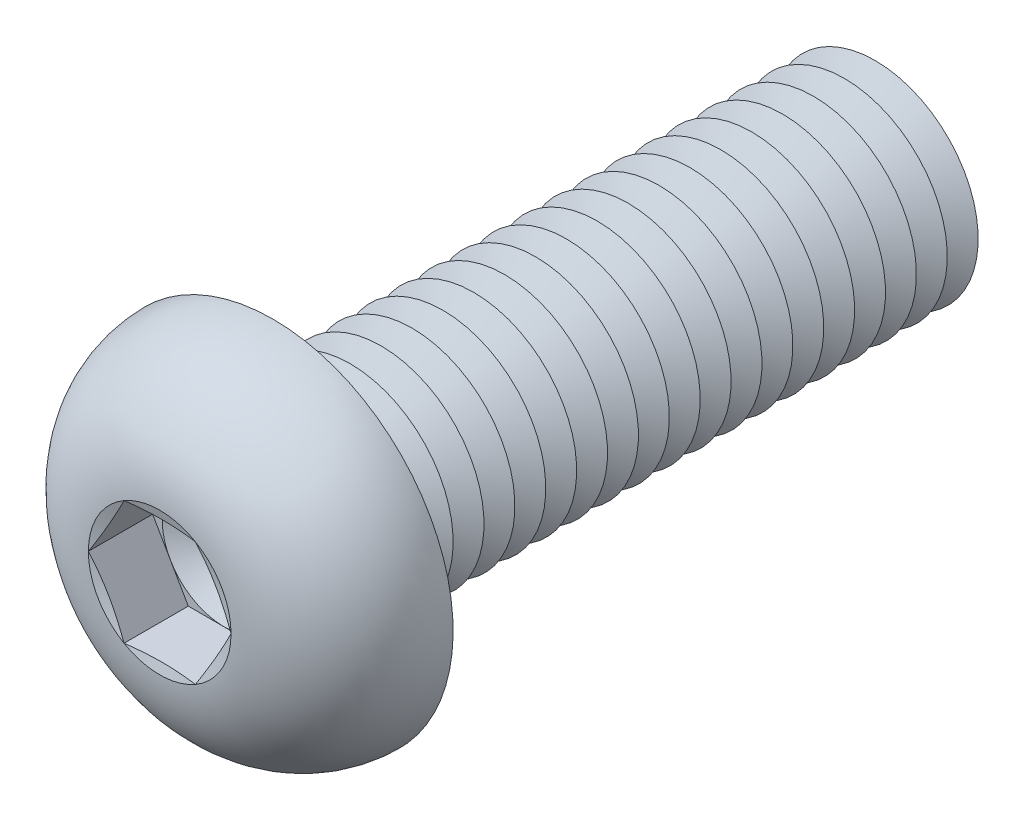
from build123d import *

# Parameters (mm, degrees)
FILLET1_R          = 0.75
LPATTERN1_COUNT    = 20
LPATTERN1_PITCH    = 1.5
CUT_EXTRUDE1_DEPTH = 3.12


with BuildPart() as part:
    # Sketch1 → Revolve1 (revolve)
    with BuildSketch(Plane(origin=(0, 0, 0), x_dir=(0, 0, -1), z_dir=(1, 0, 0))):
        with BuildLine():
            Line((0, 5), (0, 8.75))
            ThreePointArc((0, 8.75), (-3.814142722, 7.21429474), (-5.5, 3.4641))
            Line((-5.5, 3.4641), (-5.035898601, 1.73205))
            Line((-5.035898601, 1.73205), (-5.5, 1.73205))
            Line((-5.5, 1.73205), (-5.5, 0))
            Line((-5.5, 0), (30, 0))
            Line((30, 0), (30, 5))
            Line((30, 5), (0, 5))
        make_face()
    revolve(axis=Axis((0, 0, -30), (0, 0, 1)))

    # Fillet1
    fillet1_edges = [part.edges().sort_by_distance(p)[0] for p in [
        (0, -5, 0),
    ]]
    fillet(fillet1_edges, radius=FILLET1_R)

    # Sketch2 → Cut-Revolve1 (revolve, cut)
    with BuildSketch(Plane(origin=(0, 0, 0), x_dir=(0, 0, -1), z_dir=(1, 0, 0))):
        Polygon((29.25, 5), (30.75, 5), (30, 3.700961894), align=None)
    cut_revolve1 = revolve(axis=Axis((0, 0, -30), (0, 0, -1)), mode=Mode.SUBTRACT)

    # LPattern1: Cut-Revolve1 ×20
    with Locations(*[(0, 0, i * LPATTERN1_PITCH) for i in range(1, LPATTERN1_COUNT)]):
        add(cut_revolve1, mode=Mode.SUBTRACT)

    # Sketch3 → Cut-Extrude1 (cut)
    with BuildSketch(Plane.XY.offset(5.5)):
        Polygon((1.73205, 2.999998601), (-1.73205, 2.999998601), (-3.4641, 0), (-1.73205, -2.999998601), (1.73205, -2.999998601), (3.4641, 0), align=None)
    extrude(amount=-CUT_EXTRUDE1_DEPTH, mode=Mode.SUBTRACT)

    # Cut-Extrude2 cone 1 section (on through the dimple's axis) → Cut-Extrude2 (revolve, cut)
    with BuildSketch(Plane(origin=(0, 0, 2.38), x_dir=(0, -1, 0), z_dir=(1, 0, 0))):
        Polygon((0, 0), (2.999998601, 0), (0, 1.73205), align=None)
    revolve(axis=Axis((0, 0, 2.38), (0, 0, -1)), mode=Mode.SUBTRACT)


solid = part.part
